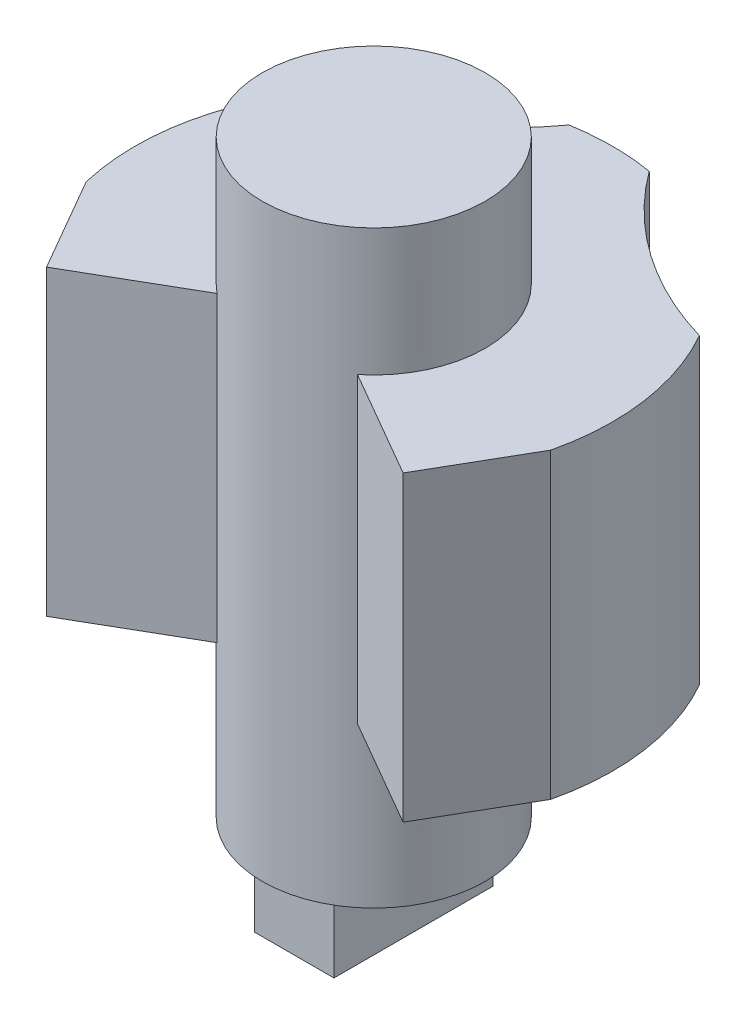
ISO-10303-21;
HEADER;
FILE_DESCRIPTION(('STEP AP214'),'2;1');
FILE_NAME('part.step','',(''),(''),'','','');
FILE_SCHEMA(('AUTOMOTIVE_DESIGN { 1 0 10303 214 1 1 1 1 }'));
ENDSEC;
DATA;
#1=APPLICATION_CONTEXT('core data for automotive mechanical design processes');
#2=APPLICATION_PROTOCOL_DEFINITION('international standard','automotive_design',2000,#1);
#3=PRODUCT_CONTEXT('',#1,'mechanical');
#4=PRODUCT('Part','Part','',(#3));
#5=PRODUCT_RELATED_PRODUCT_CATEGORY('part','',(#4));
#6=PRODUCT_DEFINITION_FORMATION('','',#4);
#7=PRODUCT_DEFINITION_CONTEXT('part definition',#1,'design');
#8=PRODUCT_DEFINITION('design','',#6,#7);
#9=PRODUCT_DEFINITION_SHAPE('','',#8);
#10=(LENGTH_UNIT() NAMED_UNIT(*) SI_UNIT(.MILLI.,.METRE.));
#11=(NAMED_UNIT(*) PLANE_ANGLE_UNIT() SI_UNIT($,.RADIAN.));
#12=(NAMED_UNIT(*) SI_UNIT($,.STERADIAN.) SOLID_ANGLE_UNIT());
#13=UNCERTAINTY_MEASURE_WITH_UNIT(LENGTH_MEASURE(1.E-05),#10,'distance_accuracy_value','');
#14=(GEOMETRIC_REPRESENTATION_CONTEXT(3) GLOBAL_UNCERTAINTY_ASSIGNED_CONTEXT((#13)) GLOBAL_UNIT_ASSIGNED_CONTEXT((#10,
#11,#12)) REPRESENTATION_CONTEXT('',''));
#15=CARTESIAN_POINT('',(0.,0.,0.));
#16=DIRECTION('',(0.,0.,1.));
#17=DIRECTION('',(1.,0.,0.));
#18=AXIS2_PLACEMENT_3D('',#15,#16,#17);
#19=CARTESIAN_POINT('',(0.,-6.35,0.));
#20=DIRECTION('',(0.,-1.,0.));
#21=DIRECTION('',(0.,0.,-1.));
#22=AXIS2_PLACEMENT_3D('',#19,#20,#21);
#23=PLANE('',#22);
#24=CARTESIAN_POINT('',(0.,-6.35,0.));
#25=DIRECTION('',(0.,-1.,0.));
#26=DIRECTION('',(0.,0.,-1.));
#27=AXIS2_PLACEMENT_3D('',#24,#25,#26);
#28=CIRCLE('',#27,4.445);
#29=CARTESIAN_POINT('',(0.,-6.35,-4.445));
#30=VERTEX_POINT('',#29);
#31=EDGE_CURVE('E154',#30,#30,#28,.T.);
#32=ORIENTED_EDGE('',*,*,#31,.T.);
#33=EDGE_LOOP('',(#32));
#34=FACE_BOUND('',#33,.T.);
#35=DIRECTION('',(-1.,0.,0.));
#36=VECTOR('',#35,1.);
#37=CARTESIAN_POINT('',(1.58750000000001,-6.35,-3.175));
#38=LINE('',#37,#36);
#39=CARTESIAN_POINT('',(1.58750000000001,-6.35,-3.175));
#40=VERTEX_POINT('',#39);
#41=CARTESIAN_POINT('',(-1.58749999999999,-6.35,-3.175));
#42=VERTEX_POINT('',#41);
#43=EDGE_CURVE('E51',#40,#42,#38,.T.);
#44=ORIENTED_EDGE('',*,*,#43,.T.);
#45=DIRECTION('',(0.,0.,-1.));
#46=VECTOR('',#45,1.);
#47=CARTESIAN_POINT('',(-1.58749999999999,-6.35,3.175));
#48=LINE('',#47,#46);
#49=CARTESIAN_POINT('',(-1.58749999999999,-6.35,3.175));
#50=VERTEX_POINT('',#49);
#51=EDGE_CURVE('E152',#50,#42,#48,.T.);
#52=ORIENTED_EDGE('',*,*,#51,.F.);
#53=DIRECTION('',(1.,0.,0.));
#54=VECTOR('',#53,1.);
#55=CARTESIAN_POINT('',(-1.58749999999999,-6.35,3.175));
#56=LINE('',#55,#54);
#57=CARTESIAN_POINT('',(1.58750000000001,-6.35,3.175));
#58=VERTEX_POINT('',#57);
#59=EDGE_CURVE('E147',#50,#58,#56,.T.);
#60=ORIENTED_EDGE('',*,*,#59,.T.);
#61=DIRECTION('',(0.,0.,1.));
#62=VECTOR('',#61,1.);
#63=CARTESIAN_POINT('',(1.58750000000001,-6.35,-3.175));
#64=LINE('',#63,#62);
#65=EDGE_CURVE('E56',#40,#58,#64,.T.);
#66=ORIENTED_EDGE('',*,*,#65,.F.);
#67=EDGE_LOOP('',(#44,#52,#60,#66));
#68=FACE_BOUND('',#67,.T.);
#69=ADVANCED_FACE('F34',(#34,#68),#23,.T.);
#70=CARTESIAN_POINT('',(0.,12.065,0.));
#71=DIRECTION('',(0.,-1.,0.));
#72=DIRECTION('',(0.,0.,-1.));
#73=AXIS2_PLACEMENT_3D('',#70,#71,#72);
#74=PLANE('',#73);
#75=CARTESIAN_POINT('',(0.,12.065,0.));
#76=DIRECTION('',(0.,1.,0.));
#77=DIRECTION('',(0.,0.,1.));
#78=AXIS2_PLACEMENT_3D('',#75,#76,#77);
#79=CIRCLE('',#78,4.445);
#80=CARTESIAN_POINT('',(2.8018586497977,12.065,3.45074095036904));
#81=VERTEX_POINT('',#80);
#82=CARTESIAN_POINT('',(-2.8018586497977,12.065,3.45074095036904));
#83=VERTEX_POINT('',#82);
#84=EDGE_CURVE('E183',#81,#83,#79,.T.);
#85=ORIENTED_EDGE('',*,*,#84,.F.);
#86=DIRECTION('',(0.86602540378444,0.,0.499999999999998));
#87=VECTOR('',#86,1.);
#88=CARTESIAN_POINT('',(2.8018586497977,12.065,3.45074095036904));
#89=LINE('',#88,#87);
#90=CARTESIAN_POINT('',(7.11143813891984,12.065,5.93887782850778));
#91=VERTEX_POINT('',#90);
#92=EDGE_CURVE('E199',#81,#91,#89,.T.);
#93=ORIENTED_EDGE('',*,*,#92,.T.);
#94=DIRECTION('',(0.499999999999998,0.,-0.86602540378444));
#95=VECTOR('',#94,1.);
#96=CARTESIAN_POINT('',(7.11143813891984,12.065,5.93887782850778));
#97=LINE('',#96,#95);
#98=CARTESIAN_POINT('',(9.26560709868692,12.065,2.20774774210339));
#99=VERTEX_POINT('',#98);
#100=EDGE_CURVE('E201',#91,#99,#97,.T.);
#101=ORIENTED_EDGE('',*,*,#100,.T.);
#102=CARTESIAN_POINT('',(0.,12.065,0.));
#103=DIRECTION('',(0.,-1.,0.));
#104=DIRECTION('',(0.,0.,-1.));
#105=AXIS2_PLACEMENT_3D('',#102,#103,#104);
#106=CIRCLE('',#105,9.525);
#107=CARTESIAN_POINT('',(8.27632286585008,12.065,-4.71466911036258));
#108=VERTEX_POINT('',#107);
#109=EDGE_CURVE('E257',#108,#99,#106,.T.);
#110=ORIENTED_EDGE('',*,*,#109,.F.);
#111=CARTESIAN_POINT('',(11.8371837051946,12.065,-16.9052503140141));
#112=DIRECTION('',(0.,-1.,0.));
#113=DIRECTION('',(0.,0.,-1.));
#114=AXIS2_PLACEMENT_3D('',#111,#112,#113);
#115=CIRCLE('',#114,12.7);
#116=CARTESIAN_POINT('',(1.59967063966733,12.065,-9.38971132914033));
#117=VERTEX_POINT('',#116);
#118=EDGE_CURVE('E255',#108,#117,#115,.T.);
#119=ORIENTED_EDGE('',*,*,#118,.T.);
#120=CARTESIAN_POINT('',(0.,12.065,0.));
#121=DIRECTION('',(0.,-1.,0.));
#122=DIRECTION('',(0.,0.,-1.));
#123=AXIS2_PLACEMENT_3D('',#120,#121,#122);
#124=CIRCLE('',#123,9.525);
#125=CARTESIAN_POINT('',(-1.59967063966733,12.065,-9.38971132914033));
#126=VERTEX_POINT('',#125);
#127=EDGE_CURVE('E252',#126,#117,#124,.T.);
#128=ORIENTED_EDGE('',*,*,#127,.F.);
#129=CARTESIAN_POINT('',(-11.8371837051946,12.065,-16.9052503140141));
#130=DIRECTION('',(0.,1.,0.));
#131=DIRECTION('',(0.,0.,-1.));
#132=AXIS2_PLACEMENT_3D('',#129,#130,#131);
#133=CIRCLE('',#132,12.7);
#134=CARTESIAN_POINT('',(-8.27632286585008,12.065,-4.71466911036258));
#135=VERTEX_POINT('',#134);
#136=EDGE_CURVE('E192',#135,#126,#133,.T.);
#137=ORIENTED_EDGE('',*,*,#136,.F.);
#138=CARTESIAN_POINT('',(0.,12.065,0.));
#139=DIRECTION('',(0.,1.,0.));
#140=DIRECTION('',(0.,0.,-1.));
#141=AXIS2_PLACEMENT_3D('',#138,#139,#140);
#142=CIRCLE('',#141,9.525);
#143=CARTESIAN_POINT('',(-9.26560709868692,12.065,2.20774774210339));
#144=VERTEX_POINT('',#143);
#145=EDGE_CURVE('E235',#135,#144,#142,.T.);
#146=ORIENTED_EDGE('',*,*,#145,.T.);
#147=DIRECTION('',(-0.499999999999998,0.,-0.86602540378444));
#148=VECTOR('',#147,1.);
#149=CARTESIAN_POINT('',(-7.11143813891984,12.065,5.93887782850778));
#150=LINE('',#149,#148);
#151=CARTESIAN_POINT('',(-7.11143813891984,12.065,5.93887782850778));
#152=VERTEX_POINT('',#151);
#153=EDGE_CURVE('E213',#152,#144,#150,.T.);
#154=ORIENTED_EDGE('',*,*,#153,.F.);
#155=DIRECTION('',(-0.86602540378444,0.,0.499999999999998));
#156=VECTOR('',#155,1.);
#157=CARTESIAN_POINT('',(-2.8018586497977,12.065,3.45074095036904));
#158=LINE('',#157,#156);
#159=EDGE_CURVE('E209',#83,#152,#158,.T.);
#160=ORIENTED_EDGE('',*,*,#159,.F.);
#161=EDGE_LOOP('',(#85,#93,#101,#110,#119,#128,#137,#146,#154,#160));
#162=FACE_BOUND('',#161,.T.);
#163=ADVANCED_FACE('F292',(#162),#74,.F.);
#164=CARTESIAN_POINT('',(0.,12.065,0.));
#165=DIRECTION('',(0.,-1.,0.));
#166=DIRECTION('',(0.,0.,-1.));
#167=AXIS2_PLACEMENT_3D('',#164,#165,#166);
#168=CYLINDRICAL_SURFACE('',#167,9.525);
#169=CARTESIAN_POINT('',(0.,0.,0.));
#170=DIRECTION('',(0.,-1.,0.));
#171=DIRECTION('',(0.,0.,-1.));
#172=AXIS2_PLACEMENT_3D('',#169,#170,#171);
#173=CIRCLE('',#172,9.525);
#174=CARTESIAN_POINT('',(-1.59967063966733,0.,-9.38971132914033));
#175=VERTEX_POINT('',#174);
#176=CARTESIAN_POINT('',(1.59967063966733,0.,-9.38971132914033));
#177=VERTEX_POINT('',#176);
#178=EDGE_CURVE('E219',#175,#177,#173,.T.);
#179=ORIENTED_EDGE('',*,*,#178,.F.);
#180=DIRECTION('',(0.,-1.,0.));
#181=VECTOR('',#180,1.);
#182=CARTESIAN_POINT('',(-1.59967063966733,12.065,-9.38971132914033));
#183=LINE('',#182,#181);
#184=EDGE_CURVE('E212',#126,#175,#183,.T.);
#185=ORIENTED_EDGE('',*,*,#184,.F.);
#186=ORIENTED_EDGE('',*,*,#127,.T.);
#187=DIRECTION('',(0.,-1.,0.));
#188=VECTOR('',#187,1.);
#189=CARTESIAN_POINT('',(1.59967063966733,12.065,-9.38971132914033));
#190=LINE('',#189,#188);
#191=EDGE_CURVE('E197',#117,#177,#190,.T.);
#192=ORIENTED_EDGE('',*,*,#191,.T.);
#193=EDGE_LOOP('',(#179,#185,#186,#192));
#194=FACE_BOUND('',#193,.T.);
#195=ADVANCED_FACE('F36',(#194),#168,.T.);
#196=CARTESIAN_POINT('',(0.,12.065,0.));
#197=DIRECTION('',(0.,-1.,0.));
#198=DIRECTION('',(0.,0.,-1.));
#199=AXIS2_PLACEMENT_3D('',#196,#197,#198);
#200=CYLINDRICAL_SURFACE('',#199,4.445);
#201=DIRECTION('',(0.,-1.,0.));
#202=VECTOR('',#201,1.);
#203=CARTESIAN_POINT('',(-2.8018586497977,12.065,3.45074095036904));
#204=LINE('',#203,#202);
#205=CARTESIAN_POINT('',(-2.8018586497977,0.,3.45074095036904));
#206=VERTEX_POINT('',#205);
#207=EDGE_CURVE('E216',#83,#206,#204,.T.);
#208=ORIENTED_EDGE('',*,*,#207,.T.);
#209=CARTESIAN_POINT('',(0.,0.,0.));
#210=DIRECTION('',(0.,-1.,0.));
#211=DIRECTION('',(0.,0.,-1.));
#212=AXIS2_PLACEMENT_3D('',#209,#210,#211);
#213=CIRCLE('',#212,4.445);
#214=CARTESIAN_POINT('',(2.8018586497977,0.,3.45074095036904));
#215=VERTEX_POINT('',#214);
#216=EDGE_CURVE('E11',#206,#215,#213,.T.);
#217=ORIENTED_EDGE('',*,*,#216,.T.);
#218=DIRECTION('',(0.,-1.,0.));
#219=VECTOR('',#218,1.);
#220=CARTESIAN_POINT('',(2.8018586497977,12.065,3.45074095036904));
#221=LINE('',#220,#219);
#222=EDGE_CURVE('E43',#81,#215,#221,.T.);
#223=ORIENTED_EDGE('',*,*,#222,.F.);
#224=ORIENTED_EDGE('',*,*,#84,.T.);
#225=EDGE_LOOP('',(#208,#217,#223,#224));
#226=FACE_BOUND('',#225,.T.);
#227=CARTESIAN_POINT('',(0.,17.145,0.));
#228=DIRECTION('',(0.,1.,0.));
#229=DIRECTION('',(0.,0.,1.));
#230=AXIS2_PLACEMENT_3D('',#227,#228,#229);
#231=CIRCLE('',#230,4.445);
#232=CARTESIAN_POINT('',(0.,17.145,4.445));
#233=VERTEX_POINT('',#232);
#234=EDGE_CURVE('E184',#233,#233,#231,.T.);
#235=ORIENTED_EDGE('',*,*,#234,.F.);
#236=EDGE_LOOP('',(#235));
#237=FACE_BOUND('',#236,.T.);
#238=ORIENTED_EDGE('',*,*,#31,.F.);
#239=EDGE_LOOP('',(#238));
#240=FACE_BOUND('',#239,.T.);
#241=ADVANCED_FACE('F307',(#226,#237,#240),#200,.T.);
#242=CARTESIAN_POINT('',(2.8018586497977,12.065,3.45074095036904));
#243=DIRECTION('',(0.499999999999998,0.,-0.86602540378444));
#244=DIRECTION('',(-0.86602540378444,0.,-0.499999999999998));
#245=AXIS2_PLACEMENT_3D('',#242,#243,#244);
#246=PLANE('',#245);
#247=DIRECTION('',(0.86602540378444,0.,0.499999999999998));
#248=VECTOR('',#247,1.);
#249=CARTESIAN_POINT('',(2.8018586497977,0.,3.45074095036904));
#250=LINE('',#249,#248);
#251=CARTESIAN_POINT('',(7.11143813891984,0.,5.93887782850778));
#252=VERTEX_POINT('',#251);
#253=EDGE_CURVE('E225',#215,#252,#250,.T.);
#254=ORIENTED_EDGE('',*,*,#253,.T.);
#255=DIRECTION('',(0.,-1.,0.));
#256=VECTOR('',#255,1.);
#257=CARTESIAN_POINT('',(7.11143813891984,12.065,5.93887782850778));
#258=LINE('',#257,#256);
#259=EDGE_CURVE('E206',#91,#252,#258,.T.);
#260=ORIENTED_EDGE('',*,*,#259,.F.);
#261=ORIENTED_EDGE('',*,*,#92,.F.);
#262=ORIENTED_EDGE('',*,*,#222,.T.);
#263=EDGE_LOOP('',(#254,#260,#261,#262));
#264=FACE_BOUND('',#263,.T.);
#265=ADVANCED_FACE('F304',(#264),#246,.F.);
#266=CARTESIAN_POINT('',(7.11143813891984,12.065,5.93887782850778));
#267=DIRECTION('',(-0.86602540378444,0.,-0.499999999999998));
#268=DIRECTION('',(-0.499999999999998,0.,0.86602540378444));
#269=AXIS2_PLACEMENT_3D('',#266,#267,#268);
#270=PLANE('',#269);
#271=DIRECTION('',(0.499999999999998,0.,-0.86602540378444));
#272=VECTOR('',#271,1.);
#273=CARTESIAN_POINT('',(7.11143813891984,0.,5.93887782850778));
#274=LINE('',#273,#272);
#275=CARTESIAN_POINT('',(9.26560709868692,0.,2.20774774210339));
#276=VERTEX_POINT('',#275);
#277=EDGE_CURVE('E269',#252,#276,#274,.T.);
#278=ORIENTED_EDGE('',*,*,#277,.T.);
#279=DIRECTION('',(0.,-1.,0.));
#280=VECTOR('',#279,1.);
#281=CARTESIAN_POINT('',(9.26560709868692,12.065,2.20774774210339));
#282=LINE('',#281,#280);
#283=EDGE_CURVE('E274',#99,#276,#282,.T.);
#284=ORIENTED_EDGE('',*,*,#283,.F.);
#285=ORIENTED_EDGE('',*,*,#100,.F.);
#286=ORIENTED_EDGE('',*,*,#259,.T.);
#287=EDGE_LOOP('',(#278,#284,#285,#286));
#288=FACE_BOUND('',#287,.T.);
#289=ADVANCED_FACE('F301',(#288),#270,.F.);
#290=CARTESIAN_POINT('',(0.,12.065,0.));
#291=DIRECTION('',(0.,-1.,0.));
#292=DIRECTION('',(0.,0.,-1.));
#293=AXIS2_PLACEMENT_3D('',#290,#291,#292);
#294=CYLINDRICAL_SURFACE('',#293,9.525);
#295=CARTESIAN_POINT('',(0.,0.,0.));
#296=DIRECTION('',(0.,-1.,0.));
#297=DIRECTION('',(0.,0.,-1.));
#298=AXIS2_PLACEMENT_3D('',#295,#296,#297);
#299=CIRCLE('',#298,9.525);
#300=CARTESIAN_POINT('',(8.27632286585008,0.,-4.71466911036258));
#301=VERTEX_POINT('',#300);
#302=EDGE_CURVE('E266',#301,#276,#299,.T.);
#303=ORIENTED_EDGE('',*,*,#302,.F.);
#304=DIRECTION('',(0.,-1.,0.));
#305=VECTOR('',#304,1.);
#306=CARTESIAN_POINT('',(8.27632286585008,12.065,-4.71466911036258));
#307=LINE('',#306,#305);
#308=EDGE_CURVE('E275',#108,#301,#307,.T.);
#309=ORIENTED_EDGE('',*,*,#308,.F.);
#310=ORIENTED_EDGE('',*,*,#109,.T.);
#311=ORIENTED_EDGE('',*,*,#283,.T.);
#312=EDGE_LOOP('',(#303,#309,#310,#311));
#313=FACE_BOUND('',#312,.T.);
#314=ADVANCED_FACE('F298',(#313),#294,.T.);
#315=CARTESIAN_POINT('',(11.8371837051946,12.065,-16.9052503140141));
#316=DIRECTION('',(0.,-1.,0.));
#317=DIRECTION('',(0.,0.,-1.));
#318=AXIS2_PLACEMENT_3D('',#315,#316,#317);
#319=CYLINDRICAL_SURFACE('',#318,12.7);
#320=CARTESIAN_POINT('',(11.8371837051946,0.,-16.9052503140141));
#321=DIRECTION('',(0.,-1.,0.));
#322=DIRECTION('',(0.,0.,-1.));
#323=AXIS2_PLACEMENT_3D('',#320,#321,#322);
#324=CIRCLE('',#323,12.7);
#325=EDGE_CURVE('E263',#301,#177,#324,.T.);
#326=ORIENTED_EDGE('',*,*,#325,.T.);
#327=ORIENTED_EDGE('',*,*,#191,.F.);
#328=ORIENTED_EDGE('',*,*,#118,.F.);
#329=ORIENTED_EDGE('',*,*,#308,.T.);
#330=EDGE_LOOP('',(#326,#327,#328,#329));
#331=FACE_BOUND('',#330,.T.);
#332=ADVANCED_FACE('F283',(#331),#319,.F.);
#333=CARTESIAN_POINT('',(0.,0.,0.));
#334=DIRECTION('',(0.,-1.,0.));
#335=DIRECTION('',(0.,0.,-1.));
#336=AXIS2_PLACEMENT_3D('',#333,#334,#335);
#337=PLANE('',#336);
#338=ORIENTED_EDGE('',*,*,#216,.F.);
#339=DIRECTION('',(-0.86602540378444,0.,0.499999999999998));
#340=VECTOR('',#339,1.);
#341=CARTESIAN_POINT('',(-2.8018586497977,0.,3.45074095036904));
#342=LINE('',#341,#340);
#343=CARTESIAN_POINT('',(-7.11143813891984,0.,5.93887782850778));
#344=VERTEX_POINT('',#343);
#345=EDGE_CURVE('E228',#206,#344,#342,.T.);
#346=ORIENTED_EDGE('',*,*,#345,.T.);
#347=DIRECTION('',(-0.499999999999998,0.,-0.86602540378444));
#348=VECTOR('',#347,1.);
#349=CARTESIAN_POINT('',(-7.11143813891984,0.,5.93887782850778));
#350=LINE('',#349,#348);
#351=CARTESIAN_POINT('',(-9.26560709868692,0.,2.20774774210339));
#352=VERTEX_POINT('',#351);
#353=EDGE_CURVE('E230',#344,#352,#350,.T.);
#354=ORIENTED_EDGE('',*,*,#353,.T.);
#355=CARTESIAN_POINT('',(0.,0.,0.));
#356=DIRECTION('',(0.,1.,0.));
#357=DIRECTION('',(0.,0.,-1.));
#358=AXIS2_PLACEMENT_3D('',#355,#356,#357);
#359=CIRCLE('',#358,9.525);
#360=CARTESIAN_POINT('',(-8.27632286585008,0.,-4.71466911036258));
#361=VERTEX_POINT('',#360);
#362=EDGE_CURVE('E236',#361,#352,#359,.T.);
#363=ORIENTED_EDGE('',*,*,#362,.F.);
#364=CARTESIAN_POINT('',(-11.8371837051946,0.,-16.9052503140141));
#365=DIRECTION('',(0.,1.,0.));
#366=DIRECTION('',(0.,0.,-1.));
#367=AXIS2_PLACEMENT_3D('',#364,#365,#366);
#368=CIRCLE('',#367,12.7);
#369=EDGE_CURVE('E188',#361,#175,#368,.T.);
#370=ORIENTED_EDGE('',*,*,#369,.T.);
#371=ORIENTED_EDGE('',*,*,#178,.T.);
#372=ORIENTED_EDGE('',*,*,#325,.F.);
#373=ORIENTED_EDGE('',*,*,#302,.T.);
#374=ORIENTED_EDGE('',*,*,#277,.F.);
#375=ORIENTED_EDGE('',*,*,#253,.F.);
#376=EDGE_LOOP('',(#338,#346,#354,#363,#370,#371,#372,#373,#374,#375));
#377=FACE_BOUND('',#376,.T.);
#378=ADVANCED_FACE('F285',(#377),#337,.T.);
#379=CARTESIAN_POINT('',(-2.8018586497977,12.065,3.45074095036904));
#380=DIRECTION('',(-0.499999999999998,0.,-0.86602540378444));
#381=DIRECTION('',(0.86602540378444,0.,-0.499999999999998));
#382=AXIS2_PLACEMENT_3D('',#379,#380,#381);
#383=PLANE('',#382);
#384=ORIENTED_EDGE('',*,*,#345,.F.);
#385=ORIENTED_EDGE('',*,*,#207,.F.);
#386=ORIENTED_EDGE('',*,*,#159,.T.);
#387=DIRECTION('',(0.,-1.,0.));
#388=VECTOR('',#387,1.);
#389=CARTESIAN_POINT('',(-7.11143813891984,12.065,5.93887782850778));
#390=LINE('',#389,#388);
#391=EDGE_CURVE('E220',#152,#344,#390,.T.);
#392=ORIENTED_EDGE('',*,*,#391,.T.);
#393=EDGE_LOOP('',(#384,#385,#386,#392));
#394=FACE_BOUND('',#393,.T.);
#395=ADVANCED_FACE('F311',(#394),#383,.F.);
#396=CARTESIAN_POINT('',(-7.11143813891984,12.065,5.93887782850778));
#397=DIRECTION('',(0.86602540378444,0.,-0.499999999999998));
#398=DIRECTION('',(0.499999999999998,0.,0.86602540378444));
#399=AXIS2_PLACEMENT_3D('',#396,#397,#398);
#400=PLANE('',#399);
#401=ORIENTED_EDGE('',*,*,#353,.F.);
#402=ORIENTED_EDGE('',*,*,#391,.F.);
#403=ORIENTED_EDGE('',*,*,#153,.T.);
#404=DIRECTION('',(0.,-1.,0.));
#405=VECTOR('',#404,1.);
#406=CARTESIAN_POINT('',(-9.26560709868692,12.065,2.20774774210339));
#407=LINE('',#406,#405);
#408=EDGE_CURVE('E244',#144,#352,#407,.T.);
#409=ORIENTED_EDGE('',*,*,#408,.T.);
#410=EDGE_LOOP('',(#401,#402,#403,#409));
#411=FACE_BOUND('',#410,.T.);
#412=ADVANCED_FACE('F315',(#411),#400,.F.);
#413=CARTESIAN_POINT('',(0.,12.065,0.));
#414=DIRECTION('',(0.,-1.,0.));
#415=DIRECTION('',(0.,0.,-1.));
#416=AXIS2_PLACEMENT_3D('',#413,#414,#415);
#417=CYLINDRICAL_SURFACE('',#416,9.525);
#418=ORIENTED_EDGE('',*,*,#362,.T.);
#419=ORIENTED_EDGE('',*,*,#408,.F.);
#420=ORIENTED_EDGE('',*,*,#145,.F.);
#421=DIRECTION('',(0.,-1.,0.));
#422=VECTOR('',#421,1.);
#423=CARTESIAN_POINT('',(-8.27632286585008,12.065,-4.71466911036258));
#424=LINE('',#423,#422);
#425=EDGE_CURVE('E247',#135,#361,#424,.T.);
#426=ORIENTED_EDGE('',*,*,#425,.T.);
#427=EDGE_LOOP('',(#418,#419,#420,#426));
#428=FACE_BOUND('',#427,.T.);
#429=ADVANCED_FACE('F317',(#428),#417,.T.);
#430=CARTESIAN_POINT('',(-11.8371837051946,12.065,-16.9052503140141));
#431=DIRECTION('',(0.,-1.,0.));
#432=DIRECTION('',(0.,0.,-1.));
#433=AXIS2_PLACEMENT_3D('',#430,#431,#432);
#434=CYLINDRICAL_SURFACE('',#433,12.7);
#435=ORIENTED_EDGE('',*,*,#369,.F.);
#436=ORIENTED_EDGE('',*,*,#425,.F.);
#437=ORIENTED_EDGE('',*,*,#136,.T.);
#438=ORIENTED_EDGE('',*,*,#184,.T.);
#439=EDGE_LOOP('',(#435,#436,#437,#438));
#440=FACE_BOUND('',#439,.T.);
#441=ADVANCED_FACE('F288',(#440),#434,.F.);
#442=CARTESIAN_POINT('',(0.,17.145,0.));
#443=DIRECTION('',(0.,1.,0.));
#444=DIRECTION('',(0.,0.,1.));
#445=AXIS2_PLACEMENT_3D('',#442,#443,#444);
#446=PLANE('',#445);
#447=ORIENTED_EDGE('',*,*,#234,.T.);
#448=EDGE_LOOP('',(#447));
#449=FACE_BOUND('',#448,.T.);
#450=ADVANCED_FACE('F325',(#449),#446,.T.);
#451=CARTESIAN_POINT('',(-1.58749999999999,-9.525,3.175));
#452=DIRECTION('',(1.,0.,0.));
#453=DIRECTION('',(0.,0.,-1.));
#454=AXIS2_PLACEMENT_3D('',#451,#452,#453);
#455=PLANE('',#454);
#456=ORIENTED_EDGE('',*,*,#51,.T.);
#457=DIRECTION('',(0.,1.,0.));
#458=VECTOR('',#457,1.);
#459=CARTESIAN_POINT('',(-1.58749999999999,-9.525,-3.175));
#460=LINE('',#459,#458);
#461=CARTESIAN_POINT('',(-1.58749999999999,-9.525,-3.175));
#462=VERTEX_POINT('',#461);
#463=EDGE_CURVE('E150',#462,#42,#460,.T.);
#464=ORIENTED_EDGE('',*,*,#463,.F.);
#465=DIRECTION('',(0.,0.,-1.));
#466=VECTOR('',#465,1.);
#467=CARTESIAN_POINT('',(-1.58749999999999,-9.525,3.175));
#468=LINE('',#467,#466);
#469=CARTESIAN_POINT('',(-1.58749999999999,-9.525,3.175));
#470=VERTEX_POINT('',#469);
#471=EDGE_CURVE('E137',#470,#462,#468,.T.);
#472=ORIENTED_EDGE('',*,*,#471,.F.);
#473=DIRECTION('',(0.,1.,0.));
#474=VECTOR('',#473,1.);
#475=CARTESIAN_POINT('',(-1.58749999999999,-9.525,3.175));
#476=LINE('',#475,#474);
#477=EDGE_CURVE('E170',#470,#50,#476,.T.);
#478=ORIENTED_EDGE('',*,*,#477,.T.);
#479=EDGE_LOOP('',(#456,#464,#472,#478));
#480=FACE_BOUND('',#479,.T.);
#481=ADVANCED_FACE('F151',(#480),#455,.F.);
#482=CARTESIAN_POINT('',(1.58750000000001,-9.525,-3.175));
#483=DIRECTION('',(0.,0.,-1.));
#484=DIRECTION('',(-1.,0.,0.));
#485=AXIS2_PLACEMENT_3D('',#482,#483,#484);
#486=PLANE('',#485);
#487=ORIENTED_EDGE('',*,*,#43,.F.);
#488=DIRECTION('',(0.,1.,0.));
#489=VECTOR('',#488,1.);
#490=CARTESIAN_POINT('',(1.58750000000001,-9.525,-3.175));
#491=LINE('',#490,#489);
#492=CARTESIAN_POINT('',(1.58750000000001,-9.525,-3.175));
#493=VERTEX_POINT('',#492);
#494=EDGE_CURVE('E155',#493,#40,#491,.T.);
#495=ORIENTED_EDGE('',*,*,#494,.F.);
#496=DIRECTION('',(-1.,0.,0.));
#497=VECTOR('',#496,1.);
#498=CARTESIAN_POINT('',(1.58750000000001,-9.525,-3.175));
#499=LINE('',#498,#497);
#500=EDGE_CURVE('E141',#493,#462,#499,.T.);
#501=ORIENTED_EDGE('',*,*,#500,.T.);
#502=ORIENTED_EDGE('',*,*,#463,.T.);
#503=EDGE_LOOP('',(#487,#495,#501,#502));
#504=FACE_BOUND('',#503,.T.);
#505=ADVANCED_FACE('F157',(#504),#486,.T.);
#506=CARTESIAN_POINT('',(1.58750000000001,-9.525,-3.175));
#507=DIRECTION('',(-1.,0.,0.));
#508=DIRECTION('',(0.,0.,1.));
#509=AXIS2_PLACEMENT_3D('',#506,#507,#508);
#510=PLANE('',#509);
#511=ORIENTED_EDGE('',*,*,#65,.T.);
#512=DIRECTION('',(0.,1.,0.));
#513=VECTOR('',#512,1.);
#514=CARTESIAN_POINT('',(1.58750000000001,-9.525,3.175));
#515=LINE('',#514,#513);
#516=CARTESIAN_POINT('',(1.58750000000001,-9.525,3.175));
#517=VERTEX_POINT('',#516);
#518=EDGE_CURVE('E176',#517,#58,#515,.T.);
#519=ORIENTED_EDGE('',*,*,#518,.F.);
#520=DIRECTION('',(0.,0.,1.));
#521=VECTOR('',#520,1.);
#522=CARTESIAN_POINT('',(1.58750000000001,-9.525,-3.175));
#523=LINE('',#522,#521);
#524=EDGE_CURVE('E160',#493,#517,#523,.T.);
#525=ORIENTED_EDGE('',*,*,#524,.F.);
#526=ORIENTED_EDGE('',*,*,#494,.T.);
#527=EDGE_LOOP('',(#511,#519,#525,#526));
#528=FACE_BOUND('',#527,.T.);
#529=ADVANCED_FACE('F463',(#528),#510,.F.);
#530=CARTESIAN_POINT('',(-1.58749999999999,-9.525,3.175));
#531=DIRECTION('',(0.,0.,1.));
#532=DIRECTION('',(1.,0.,0.));
#533=AXIS2_PLACEMENT_3D('',#530,#531,#532);
#534=PLANE('',#533);
#535=ORIENTED_EDGE('',*,*,#59,.F.);
#536=ORIENTED_EDGE('',*,*,#477,.F.);
#537=DIRECTION('',(1.,0.,0.));
#538=VECTOR('',#537,1.);
#539=CARTESIAN_POINT('',(-1.58749999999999,-9.525,3.175));
#540=LINE('',#539,#538);
#541=EDGE_CURVE('E143',#470,#517,#540,.T.);
#542=ORIENTED_EDGE('',*,*,#541,.T.);
#543=ORIENTED_EDGE('',*,*,#518,.T.);
#544=EDGE_LOOP('',(#535,#536,#542,#543));
#545=FACE_BOUND('',#544,.T.);
#546=ADVANCED_FACE('F467',(#545),#534,.T.);
#547=CARTESIAN_POINT('',(-1.58749999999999,-9.525,-3.175));
#548=DIRECTION('',(0.,1.,0.));
#549=DIRECTION('',(0.,0.,1.));
#550=AXIS2_PLACEMENT_3D('',#547,#548,#549);
#551=PLANE('',#550);
#552=ORIENTED_EDGE('',*,*,#471,.T.);
#553=ORIENTED_EDGE('',*,*,#500,.F.);
#554=ORIENTED_EDGE('',*,*,#524,.T.);
#555=ORIENTED_EDGE('',*,*,#541,.F.);
#556=EDGE_LOOP('',(#552,#553,#554,#555));
#557=FACE_BOUND('',#556,.T.);
#558=ADVANCED_FACE('F139',(#557),#551,.F.);
#559=CLOSED_SHELL('',(#69,#163,#195,#241,#265,#289,#314,#332,#378,#395,#412,#429,#441,#450,#481,
#505,#529,#546,#558));
#560=MANIFOLD_SOLID_BREP('B2',#559);
#561=ADVANCED_BREP_SHAPE_REPRESENTATION('',(#18,#560),#14);
#562=SHAPE_DEFINITION_REPRESENTATION(#9,#561);
ENDSEC;
END-ISO-10303-21;
